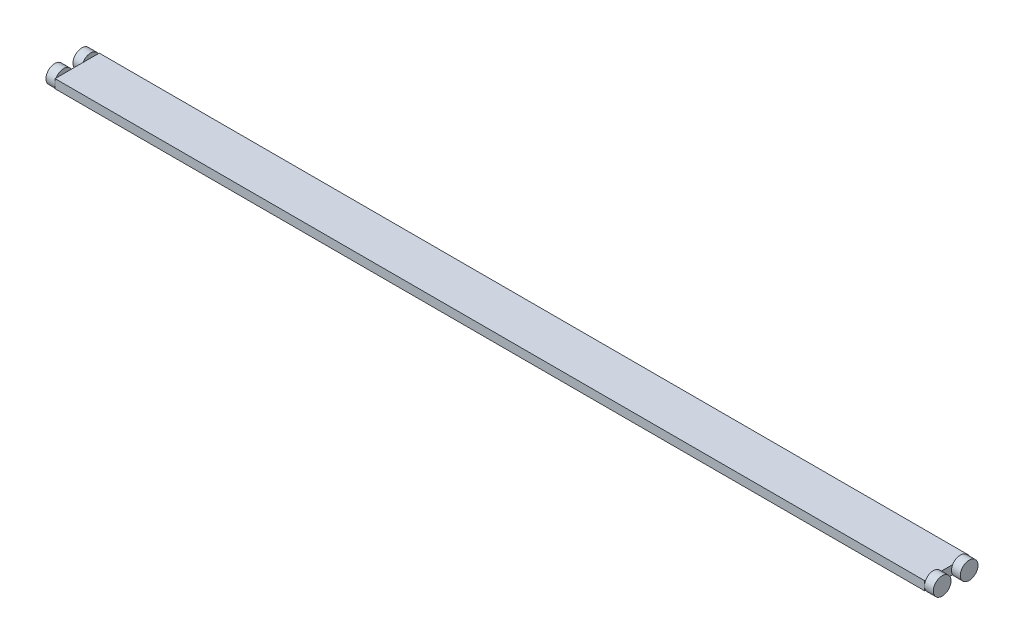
ISO-10303-21;
HEADER;
FILE_DESCRIPTION(('STEP AP214'),'2;1');
FILE_NAME('part.step','',(''),(''),'','','');
FILE_SCHEMA(('AUTOMOTIVE_DESIGN { 1 0 10303 214 1 1 1 1 }'));
ENDSEC;
DATA;
#1=APPLICATION_CONTEXT('core data for automotive mechanical design processes');
#2=APPLICATION_PROTOCOL_DEFINITION('international standard','automotive_design',2000,#1);
#3=PRODUCT_CONTEXT('',#1,'mechanical');
#4=PRODUCT('Part','Part','',(#3));
#5=PRODUCT_RELATED_PRODUCT_CATEGORY('part','',(#4));
#6=PRODUCT_DEFINITION_FORMATION('','',#4);
#7=PRODUCT_DEFINITION_CONTEXT('part definition',#1,'design');
#8=PRODUCT_DEFINITION('design','',#6,#7);
#9=PRODUCT_DEFINITION_SHAPE('','',#8);
#10=(LENGTH_UNIT() NAMED_UNIT(*) SI_UNIT(.MILLI.,.METRE.));
#11=(NAMED_UNIT(*) PLANE_ANGLE_UNIT() SI_UNIT($,.RADIAN.));
#12=(NAMED_UNIT(*) SI_UNIT($,.STERADIAN.) SOLID_ANGLE_UNIT());
#13=UNCERTAINTY_MEASURE_WITH_UNIT(LENGTH_MEASURE(1.E-05),#10,'distance_accuracy_value','');
#14=(GEOMETRIC_REPRESENTATION_CONTEXT(3) GLOBAL_UNCERTAINTY_ASSIGNED_CONTEXT((#13)) GLOBAL_UNIT_ASSIGNED_CONTEXT((#10,
#11,#12)) REPRESENTATION_CONTEXT('',''));
#15=CARTESIAN_POINT('',(0.,0.,0.));
#16=DIRECTION('',(0.,0.,1.));
#17=DIRECTION('',(1.,0.,0.));
#18=AXIS2_PLACEMENT_3D('',#15,#16,#17);
#19=CARTESIAN_POINT('',(-492.,5.,25.));
#20=DIRECTION('',(1.,0.,0.));
#21=DIRECTION('',(0.,0.,-1.));
#22=AXIS2_PLACEMENT_3D('',#19,#20,#21);
#23=PLANE('',#22);
#24=DIRECTION('',(0.,0.,1.));
#25=VECTOR('',#24,1.);
#26=CARTESIAN_POINT('',(-492.,5.,25.));
#27=LINE('',#26,#25);
#28=CARTESIAN_POINT('',(-492.,5.,23.9431883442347));
#29=VERTEX_POINT('',#28);
#30=CARTESIAN_POINT('',(-492.,5.,25.));
#31=VERTEX_POINT('',#30);
#32=EDGE_CURVE('E231',#29,#31,#27,.T.);
#33=ORIENTED_EDGE('',*,*,#32,.F.);
#34=CARTESIAN_POINT('',(-492.,0.,15.2829343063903));
#35=DIRECTION('',(1.,0.,0.));
#36=DIRECTION('',(0.,0.,-1.));
#37=AXIS2_PLACEMENT_3D('',#34,#35,#36);
#38=CIRCLE('',#37,10.);
#39=CARTESIAN_POINT('',(-492.,2.36191327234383,25.));
#40=VERTEX_POINT('',#39);
#41=EDGE_CURVE('E61',#29,#40,#38,.T.);
#42=ORIENTED_EDGE('',*,*,#41,.T.);
#43=DIRECTION('',(0.,-1.,0.));
#44=VECTOR('',#43,1.);
#45=CARTESIAN_POINT('',(-492.,5.,25.));
#46=LINE('',#45,#44);
#47=EDGE_CURVE('E257',#31,#40,#46,.T.);
#48=ORIENTED_EDGE('',*,*,#47,.F.);
#49=EDGE_LOOP('',(#33,#42,#48));
#50=FACE_BOUND('',#49,.T.);
#51=ADVANCED_FACE('F35',(#50),#23,.F.);
#52=CARTESIAN_POINT('',(-492.,-2.36191327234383,25.));
#53=VERTEX_POINT('',#52);
#54=CARTESIAN_POINT('',(-492.,-5.,25.));
#55=VERTEX_POINT('',#54);
#56=EDGE_CURVE('E53',#53,#55,#46,.T.);
#57=ORIENTED_EDGE('',*,*,#56,.F.);
#58=CARTESIAN_POINT('',(-492.,-5.,23.9431883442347));
#59=VERTEX_POINT('',#58);
#60=EDGE_CURVE('E165',#53,#59,#38,.T.);
#61=ORIENTED_EDGE('',*,*,#60,.T.);
#62=DIRECTION('',(0.,0.,1.));
#63=VECTOR('',#62,1.);
#64=CARTESIAN_POINT('',(-492.,-5.,25.));
#65=LINE('',#64,#63);
#66=EDGE_CURVE('E152',#59,#55,#65,.T.);
#67=ORIENTED_EDGE('',*,*,#66,.T.);
#68=EDGE_LOOP('',(#57,#61,#67));
#69=FACE_BOUND('',#68,.T.);
#70=ADVANCED_FACE('F166',(#69),#23,.F.);
#71=DIRECTION('',(0.,-1.,0.));
#72=VECTOR('',#71,1.);
#73=CARTESIAN_POINT('',(-492.,5.,-25.));
#74=LINE('',#73,#72);
#75=CARTESIAN_POINT('',(-492.,5.,-25.));
#76=VERTEX_POINT('',#75);
#77=CARTESIAN_POINT('',(-492.,2.36191327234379,-25.));
#78=VERTEX_POINT('',#77);
#79=EDGE_CURVE('E259',#76,#78,#74,.T.);
#80=ORIENTED_EDGE('',*,*,#79,.T.);
#81=CARTESIAN_POINT('',(-492.,0.,-15.2829343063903));
#82=DIRECTION('',(1.,0.,0.));
#83=DIRECTION('',(0.,0.,-1.));
#84=AXIS2_PLACEMENT_3D('',#81,#82,#83);
#85=CIRCLE('',#84,10.);
#86=CARTESIAN_POINT('',(-492.,5.,-23.9431883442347));
#87=VERTEX_POINT('',#86);
#88=EDGE_CURVE('E197',#78,#87,#85,.T.);
#89=ORIENTED_EDGE('',*,*,#88,.T.);
#90=EDGE_CURVE('E232',#76,#87,#27,.T.);
#91=ORIENTED_EDGE('',*,*,#90,.F.);
#92=EDGE_LOOP('',(#80,#89,#91));
#93=FACE_BOUND('',#92,.T.);
#94=ADVANCED_FACE('F303',(#93),#23,.F.);
#95=CARTESIAN_POINT('',(-492.,-5.,-6.62268026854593));
#96=VERTEX_POINT('',#95);
#97=CARTESIAN_POINT('',(-492.,-5.,6.62268026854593));
#98=VERTEX_POINT('',#97);
#99=EDGE_CURVE('E177',#96,#98,#65,.T.);
#100=ORIENTED_EDGE('',*,*,#99,.T.);
#101=CARTESIAN_POINT('',(-492.,5.,6.62268026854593));
#102=VERTEX_POINT('',#101);
#103=EDGE_CURVE('E181',#98,#102,#38,.T.);
#104=ORIENTED_EDGE('',*,*,#103,.T.);
#105=CARTESIAN_POINT('',(-492.,5.,-6.62268026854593));
#106=VERTEX_POINT('',#105);
#107=EDGE_CURVE('E288',#106,#102,#27,.T.);
#108=ORIENTED_EDGE('',*,*,#107,.F.);
#109=EDGE_CURVE('E11',#106,#96,#85,.T.);
#110=ORIENTED_EDGE('',*,*,#109,.T.);
#111=EDGE_LOOP('',(#100,#104,#108,#110));
#112=FACE_BOUND('',#111,.T.);
#113=ADVANCED_FACE('F285',(#112),#23,.F.);
#114=CARTESIAN_POINT('',(492.,5.,25.));
#115=DIRECTION('',(-1.,0.,0.));
#116=DIRECTION('',(0.,0.,1.));
#117=AXIS2_PLACEMENT_3D('',#114,#115,#116);
#118=PLANE('',#117);
#119=CARTESIAN_POINT('',(492.,0.,15.2829343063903));
#120=DIRECTION('',(1.,0.,0.));
#121=DIRECTION('',(0.,0.,-1.));
#122=AXIS2_PLACEMENT_3D('',#119,#120,#121);
#123=CIRCLE('',#122,10.);
#124=CARTESIAN_POINT('',(492.,-2.36191327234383,25.));
#125=VERTEX_POINT('',#124);
#126=CARTESIAN_POINT('',(492.,-5.,23.9431883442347));
#127=VERTEX_POINT('',#126);
#128=EDGE_CURVE('E638',#125,#127,#123,.T.);
#129=ORIENTED_EDGE('',*,*,#128,.F.);
#130=DIRECTION('',(0.,-1.,0.));
#131=VECTOR('',#130,1.);
#132=CARTESIAN_POINT('',(492.,5.,25.));
#133=LINE('',#132,#131);
#134=CARTESIAN_POINT('',(492.,-5.,25.));
#135=VERTEX_POINT('',#134);
#136=EDGE_CURVE('E239',#125,#135,#133,.T.);
#137=ORIENTED_EDGE('',*,*,#136,.T.);
#138=DIRECTION('',(0.,0.,-1.));
#139=VECTOR('',#138,1.);
#140=CARTESIAN_POINT('',(492.,-5.,25.));
#141=LINE('',#140,#139);
#142=EDGE_CURVE('E240',#135,#127,#141,.T.);
#143=ORIENTED_EDGE('',*,*,#142,.T.);
#144=EDGE_LOOP('',(#129,#137,#143));
#145=FACE_BOUND('',#144,.T.);
#146=ADVANCED_FACE('F341',(#145),#118,.F.);
#147=CARTESIAN_POINT('',(492.,-5.,6.62268026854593));
#148=VERTEX_POINT('',#147);
#149=CARTESIAN_POINT('',(492.,5.,6.62268026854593));
#150=VERTEX_POINT('',#149);
#151=EDGE_CURVE('E196',#148,#150,#123,.T.);
#152=ORIENTED_EDGE('',*,*,#151,.F.);
#153=CARTESIAN_POINT('',(492.,-5.,-6.62268026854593));
#154=VERTEX_POINT('',#153);
#155=EDGE_CURVE('E244',#148,#154,#141,.T.);
#156=ORIENTED_EDGE('',*,*,#155,.T.);
#157=CARTESIAN_POINT('',(492.,0.,-15.2829343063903));
#158=DIRECTION('',(1.,0.,0.));
#159=DIRECTION('',(0.,0.,-1.));
#160=AXIS2_PLACEMENT_3D('',#157,#158,#159);
#161=CIRCLE('',#160,10.);
#162=CARTESIAN_POINT('',(492.,5.,-6.62268026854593));
#163=VERTEX_POINT('',#162);
#164=EDGE_CURVE('E316',#163,#154,#161,.T.);
#165=ORIENTED_EDGE('',*,*,#164,.F.);
#166=DIRECTION('',(0.,0.,-1.));
#167=VECTOR('',#166,1.);
#168=CARTESIAN_POINT('',(492.,5.,25.));
#169=LINE('',#168,#167);
#170=EDGE_CURVE('E227',#150,#163,#169,.T.);
#171=ORIENTED_EDGE('',*,*,#170,.F.);
#172=EDGE_LOOP('',(#152,#156,#165,#171));
#173=FACE_BOUND('',#172,.T.);
#174=ADVANCED_FACE('F317',(#173),#118,.F.);
#175=CARTESIAN_POINT('',(492.,2.36191327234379,-25.));
#176=VERTEX_POINT('',#175);
#177=CARTESIAN_POINT('',(492.,5.,-23.9431883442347));
#178=VERTEX_POINT('',#177);
#179=EDGE_CURVE('E218',#176,#178,#161,.T.);
#180=ORIENTED_EDGE('',*,*,#179,.F.);
#181=DIRECTION('',(0.,-1.,0.));
#182=VECTOR('',#181,1.);
#183=CARTESIAN_POINT('',(492.,5.,-25.));
#184=LINE('',#183,#182);
#185=CARTESIAN_POINT('',(492.,5.,-25.));
#186=VERTEX_POINT('',#185);
#187=EDGE_CURVE('E39',#186,#176,#184,.T.);
#188=ORIENTED_EDGE('',*,*,#187,.F.);
#189=EDGE_CURVE('E253',#178,#186,#169,.T.);
#190=ORIENTED_EDGE('',*,*,#189,.F.);
#191=EDGE_LOOP('',(#180,#188,#190));
#192=FACE_BOUND('',#191,.T.);
#193=ADVANCED_FACE('F333',(#192),#118,.F.);
#194=CARTESIAN_POINT('',(492.,5.,23.9431883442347));
#195=VERTEX_POINT('',#194);
#196=CARTESIAN_POINT('',(492.,2.36191327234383,25.));
#197=VERTEX_POINT('',#196);
#198=EDGE_CURVE('E207',#195,#197,#123,.T.);
#199=ORIENTED_EDGE('',*,*,#198,.F.);
#200=CARTESIAN_POINT('',(492.,5.,25.));
#201=VERTEX_POINT('',#200);
#202=EDGE_CURVE('E223',#201,#195,#169,.T.);
#203=ORIENTED_EDGE('',*,*,#202,.F.);
#204=EDGE_CURVE('E254',#201,#197,#133,.T.);
#205=ORIENTED_EDGE('',*,*,#204,.T.);
#206=EDGE_LOOP('',(#199,#203,#205));
#207=FACE_BOUND('',#206,.T.);
#208=ADVANCED_FACE('F335',(#207),#118,.F.);
#209=CARTESIAN_POINT('',(492.,-5.,-23.9431883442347));
#210=VERTEX_POINT('',#209);
#211=CARTESIAN_POINT('',(492.,-2.36191327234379,-25.));
#212=VERTEX_POINT('',#211);
#213=EDGE_CURVE('E222',#210,#212,#161,.T.);
#214=ORIENTED_EDGE('',*,*,#213,.F.);
#215=CARTESIAN_POINT('',(492.,-5.,-25.));
#216=VERTEX_POINT('',#215);
#217=EDGE_CURVE('E217',#210,#216,#141,.T.);
#218=ORIENTED_EDGE('',*,*,#217,.T.);
#219=EDGE_CURVE('E261',#212,#216,#184,.T.);
#220=ORIENTED_EDGE('',*,*,#219,.F.);
#221=EDGE_LOOP('',(#214,#218,#220));
#222=FACE_BOUND('',#221,.T.);
#223=ADVANCED_FACE('F37',(#222),#118,.F.);
#224=CARTESIAN_POINT('',(-492.,5.,-25.));
#225=DIRECTION('',(0.,0.,1.));
#226=DIRECTION('',(1.,0.,0.));
#227=AXIS2_PLACEMENT_3D('',#224,#225,#226);
#228=PLANE('',#227);
#229=DIRECTION('',(-1.,0.,0.));
#230=VECTOR('',#229,1.);
#231=CARTESIAN_POINT('',(-492.,-5.,-25.));
#232=LINE('',#231,#230);
#233=CARTESIAN_POINT('',(-492.,-5.,-25.));
#234=VERTEX_POINT('',#233);
#235=EDGE_CURVE('E161',#216,#234,#232,.T.);
#236=ORIENTED_EDGE('',*,*,#235,.T.);
#237=CARTESIAN_POINT('',(-492.,-2.36191327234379,-25.));
#238=VERTEX_POINT('',#237);
#239=EDGE_CURVE('E258',#238,#234,#74,.T.);
#240=ORIENTED_EDGE('',*,*,#239,.F.);
#241=EDGE_CURVE('E262',#78,#238,#74,.T.);
#242=ORIENTED_EDGE('',*,*,#241,.F.);
#243=ORIENTED_EDGE('',*,*,#79,.F.);
#244=DIRECTION('',(-1.,0.,0.));
#245=VECTOR('',#244,1.);
#246=CARTESIAN_POINT('',(-492.,5.,-25.));
#247=LINE('',#246,#245);
#248=EDGE_CURVE('E226',#186,#76,#247,.T.);
#249=ORIENTED_EDGE('',*,*,#248,.F.);
#250=ORIENTED_EDGE('',*,*,#187,.T.);
#251=EDGE_CURVE('E266',#176,#212,#184,.T.);
#252=ORIENTED_EDGE('',*,*,#251,.T.);
#253=ORIENTED_EDGE('',*,*,#219,.T.);
#254=EDGE_LOOP('',(#236,#240,#242,#243,#249,#250,#252,#253));
#255=FACE_BOUND('',#254,.T.);
#256=ADVANCED_FACE('F276',(#255),#228,.F.);
#257=CARTESIAN_POINT('',(-492.,-5.,-23.9431883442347));
#258=VERTEX_POINT('',#257);
#259=EDGE_CURVE('E163',#234,#258,#65,.T.);
#260=ORIENTED_EDGE('',*,*,#259,.T.);
#261=EDGE_CURVE('E44',#258,#238,#85,.T.);
#262=ORIENTED_EDGE('',*,*,#261,.T.);
#263=ORIENTED_EDGE('',*,*,#239,.T.);
#264=EDGE_LOOP('',(#260,#262,#263));
#265=FACE_BOUND('',#264,.T.);
#266=ADVANCED_FACE('F271',(#265),#23,.F.);
#267=CARTESIAN_POINT('',(-492.,5.,25.));
#268=DIRECTION('',(0.,0.,-1.));
#269=DIRECTION('',(-1.,0.,0.));
#270=AXIS2_PLACEMENT_3D('',#267,#268,#269);
#271=PLANE('',#270);
#272=DIRECTION('',(1.,0.,0.));
#273=VECTOR('',#272,1.);
#274=CARTESIAN_POINT('',(-492.,-5.,25.));
#275=LINE('',#274,#273);
#276=EDGE_CURVE('E160',#55,#135,#275,.T.);
#277=ORIENTED_EDGE('',*,*,#276,.T.);
#278=ORIENTED_EDGE('',*,*,#136,.F.);
#279=DIRECTION('',(0.,-1.,0.));
#280=VECTOR('',#279,1.);
#281=CARTESIAN_POINT('',(492.,5.,25.));
#282=LINE('',#281,#280);
#283=EDGE_CURVE('E210',#197,#125,#282,.T.);
#284=ORIENTED_EDGE('',*,*,#283,.F.);
#285=ORIENTED_EDGE('',*,*,#204,.F.);
#286=DIRECTION('',(1.,0.,0.));
#287=VECTOR('',#286,1.);
#288=CARTESIAN_POINT('',(-492.,5.,25.));
#289=LINE('',#288,#287);
#290=EDGE_CURVE('E235',#31,#201,#289,.T.);
#291=ORIENTED_EDGE('',*,*,#290,.F.);
#292=ORIENTED_EDGE('',*,*,#47,.T.);
#293=DIRECTION('',(0.,1.,0.));
#294=VECTOR('',#293,1.);
#295=CARTESIAN_POINT('',(-492.,5.,25.));
#296=LINE('',#295,#294);
#297=EDGE_CURVE('E190',#53,#40,#296,.T.);
#298=ORIENTED_EDGE('',*,*,#297,.F.);
#299=ORIENTED_EDGE('',*,*,#56,.T.);
#300=EDGE_LOOP('',(#277,#278,#284,#285,#291,#292,#298,#299));
#301=FACE_BOUND('',#300,.T.);
#302=ADVANCED_FACE('F349',(#301),#271,.F.);
#303=CARTESIAN_POINT('',(0.,5.,0.));
#304=DIRECTION('',(0.,-1.,0.));
#305=DIRECTION('',(0.,0.,-1.));
#306=AXIS2_PLACEMENT_3D('',#303,#304,#305);
#307=PLANE('',#306);
#308=ORIENTED_EDGE('',*,*,#202,.T.);
#309=DIRECTION('',(0.,0.,1.));
#310=VECTOR('',#309,1.);
#311=CARTESIAN_POINT('',(492.,5.,0.));
#312=LINE('',#311,#310);
#313=EDGE_CURVE('E203',#150,#195,#312,.T.);
#314=ORIENTED_EDGE('',*,*,#313,.F.);
#315=ORIENTED_EDGE('',*,*,#170,.T.);
#316=EDGE_CURVE('E228',#163,#178,#169,.T.);
#317=ORIENTED_EDGE('',*,*,#316,.T.);
#318=ORIENTED_EDGE('',*,*,#189,.T.);
#319=ORIENTED_EDGE('',*,*,#248,.T.);
#320=ORIENTED_EDGE('',*,*,#90,.T.);
#321=EDGE_CURVE('E236',#87,#106,#27,.T.);
#322=ORIENTED_EDGE('',*,*,#321,.T.);
#323=ORIENTED_EDGE('',*,*,#107,.T.);
#324=DIRECTION('',(0.,0.,-1.));
#325=VECTOR('',#324,1.);
#326=CARTESIAN_POINT('',(-492.,5.,0.));
#327=LINE('',#326,#325);
#328=EDGE_CURVE('E187',#29,#102,#327,.T.);
#329=ORIENTED_EDGE('',*,*,#328,.F.);
#330=ORIENTED_EDGE('',*,*,#32,.T.);
#331=ORIENTED_EDGE('',*,*,#290,.T.);
#332=EDGE_LOOP('',(#308,#314,#315,#317,#318,#319,#320,#322,#323,#329,#330,#331));
#333=FACE_BOUND('',#332,.T.);
#334=ADVANCED_FACE('F305',(#333),#307,.F.);
#335=CARTESIAN_POINT('',(0.,-5.,0.));
#336=DIRECTION('',(0.,-1.,0.));
#337=DIRECTION('',(0.,0.,-1.));
#338=AXIS2_PLACEMENT_3D('',#335,#336,#337);
#339=PLANE('',#338);
#340=ORIENTED_EDGE('',*,*,#142,.F.);
#341=ORIENTED_EDGE('',*,*,#276,.F.);
#342=ORIENTED_EDGE('',*,*,#66,.F.);
#343=EDGE_CURVE('E157',#98,#59,#65,.T.);
#344=ORIENTED_EDGE('',*,*,#343,.F.);
#345=ORIENTED_EDGE('',*,*,#99,.F.);
#346=EDGE_CURVE('E250',#258,#96,#65,.T.);
#347=ORIENTED_EDGE('',*,*,#346,.F.);
#348=ORIENTED_EDGE('',*,*,#259,.F.);
#349=ORIENTED_EDGE('',*,*,#235,.F.);
#350=ORIENTED_EDGE('',*,*,#217,.F.);
#351=EDGE_CURVE('E245',#154,#210,#141,.T.);
#352=ORIENTED_EDGE('',*,*,#351,.F.);
#353=ORIENTED_EDGE('',*,*,#155,.F.);
#354=EDGE_CURVE('E243',#127,#148,#141,.T.);
#355=ORIENTED_EDGE('',*,*,#354,.F.);
#356=EDGE_LOOP('',(#340,#341,#342,#344,#345,#347,#348,#349,#350,#352,#353,#355));
#357=FACE_BOUND('',#356,.T.);
#358=ADVANCED_FACE('F154',(#357),#339,.T.);
#359=CARTESIAN_POINT('',(492.,0.,-15.2829343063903));
#360=DIRECTION('',(1.,0.,0.));
#361=DIRECTION('',(0.,0.,-1.));
#362=AXIS2_PLACEMENT_3D('',#359,#360,#361);
#363=PLANE('',#362);
#364=EDGE_CURVE('E326',#154,#210,#161,.T.);
#365=ORIENTED_EDGE('',*,*,#364,.F.);
#366=ORIENTED_EDGE('',*,*,#351,.T.);
#367=EDGE_LOOP('',(#365,#366));
#368=FACE_BOUND('',#367,.T.);
#369=ADVANCED_FACE('F434',(#368),#363,.F.);
#370=ORIENTED_EDGE('',*,*,#251,.F.);
#371=EDGE_CURVE('E213',#212,#176,#161,.T.);
#372=ORIENTED_EDGE('',*,*,#371,.F.);
#373=EDGE_LOOP('',(#370,#372));
#374=FACE_BOUND('',#373,.T.);
#375=ADVANCED_FACE('F332',(#374),#363,.F.);
#376=CARTESIAN_POINT('',(502.,0.,-15.2829343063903));
#377=DIRECTION('',(-1.,0.,0.));
#378=DIRECTION('',(0.,0.,1.));
#379=AXIS2_PLACEMENT_3D('',#376,#377,#378);
#380=CYLINDRICAL_SURFACE('',#379,10.);
#381=CARTESIAN_POINT('',(502.,0.,-15.2829343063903));
#382=DIRECTION('',(1.,0.,0.));
#383=DIRECTION('',(0.,0.,-1.));
#384=AXIS2_PLACEMENT_3D('',#381,#382,#383);
#385=CIRCLE('',#384,10.);
#386=CARTESIAN_POINT('',(502.,0.,-25.2829343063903));
#387=VERTEX_POINT('',#386);
#388=EDGE_CURVE('E214',#387,#387,#385,.T.);
#389=ORIENTED_EDGE('',*,*,#388,.F.);
#390=EDGE_LOOP('',(#389));
#391=FACE_BOUND('',#390,.T.);
#392=ORIENTED_EDGE('',*,*,#179,.T.);
#393=EDGE_CURVE('E221',#178,#163,#161,.T.);
#394=ORIENTED_EDGE('',*,*,#393,.T.);
#395=ORIENTED_EDGE('',*,*,#164,.T.);
#396=ORIENTED_EDGE('',*,*,#364,.T.);
#397=ORIENTED_EDGE('',*,*,#213,.T.);
#398=ORIENTED_EDGE('',*,*,#371,.T.);
#399=EDGE_LOOP('',(#392,#394,#395,#396,#397,#398));
#400=FACE_BOUND('',#399,.T.);
#401=ADVANCED_FACE('F324',(#391,#400),#380,.T.);
#402=CARTESIAN_POINT('',(502.,0.,-15.2829343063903));
#403=DIRECTION('',(1.,0.,0.));
#404=DIRECTION('',(0.,0.,-1.));
#405=AXIS2_PLACEMENT_3D('',#402,#403,#404);
#406=PLANE('',#405);
#407=ORIENTED_EDGE('',*,*,#388,.T.);
#408=EDGE_LOOP('',(#407));
#409=FACE_BOUND('',#408,.T.);
#410=ADVANCED_FACE('F432',(#409),#406,.T.);
#411=ORIENTED_EDGE('',*,*,#316,.F.);
#412=ORIENTED_EDGE('',*,*,#393,.F.);
#413=EDGE_LOOP('',(#411,#412));
#414=FACE_BOUND('',#413,.T.);
#415=ADVANCED_FACE('F323',(#414),#363,.F.);
#416=CARTESIAN_POINT('',(492.,0.,15.2829343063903));
#417=DIRECTION('',(1.,0.,0.));
#418=DIRECTION('',(0.,0.,-1.));
#419=AXIS2_PLACEMENT_3D('',#416,#417,#418);
#420=PLANE('',#419);
#421=EDGE_CURVE('E639',#197,#125,#123,.T.);
#422=ORIENTED_EDGE('',*,*,#421,.F.);
#423=ORIENTED_EDGE('',*,*,#283,.T.);
#424=EDGE_LOOP('',(#422,#423));
#425=FACE_BOUND('',#424,.T.);
#426=ADVANCED_FACE('F386',(#425),#420,.F.);
#427=EDGE_CURVE('E204',#150,#195,#123,.T.);
#428=ORIENTED_EDGE('',*,*,#427,.F.);
#429=ORIENTED_EDGE('',*,*,#313,.T.);
#430=EDGE_LOOP('',(#428,#429));
#431=FACE_BOUND('',#430,.T.);
#432=ADVANCED_FACE('F387',(#431),#420,.F.);
#433=CARTESIAN_POINT('',(502.,0.,15.2829343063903));
#434=DIRECTION('',(-1.,0.,0.));
#435=DIRECTION('',(0.,0.,1.));
#436=AXIS2_PLACEMENT_3D('',#433,#434,#435);
#437=CYLINDRICAL_SURFACE('',#436,10.);
#438=CARTESIAN_POINT('',(502.,0.,15.2829343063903));
#439=DIRECTION('',(1.,0.,0.));
#440=DIRECTION('',(0.,0.,-1.));
#441=AXIS2_PLACEMENT_3D('',#438,#439,#440);
#442=CIRCLE('',#441,10.);
#443=CARTESIAN_POINT('',(502.,0.,5.28293430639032));
#444=VERTEX_POINT('',#443);
#445=EDGE_CURVE('E200',#444,#444,#442,.T.);
#446=ORIENTED_EDGE('',*,*,#445,.F.);
#447=EDGE_LOOP('',(#446));
#448=FACE_BOUND('',#447,.T.);
#449=ORIENTED_EDGE('',*,*,#427,.T.);
#450=ORIENTED_EDGE('',*,*,#198,.T.);
#451=ORIENTED_EDGE('',*,*,#421,.T.);
#452=ORIENTED_EDGE('',*,*,#128,.T.);
#453=EDGE_CURVE('E636',#127,#148,#123,.T.);
#454=ORIENTED_EDGE('',*,*,#453,.T.);
#455=ORIENTED_EDGE('',*,*,#151,.T.);
#456=EDGE_LOOP('',(#449,#450,#451,#452,#454,#455));
#457=FACE_BOUND('',#456,.T.);
#458=ADVANCED_FACE('F397',(#448,#457),#437,.T.);
#459=CARTESIAN_POINT('',(502.,0.,15.2829343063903));
#460=DIRECTION('',(1.,0.,0.));
#461=DIRECTION('',(0.,0.,-1.));
#462=AXIS2_PLACEMENT_3D('',#459,#460,#461);
#463=PLANE('',#462);
#464=ORIENTED_EDGE('',*,*,#445,.T.);
#465=EDGE_LOOP('',(#464));
#466=FACE_BOUND('',#465,.T.);
#467=ADVANCED_FACE('F383',(#466),#463,.T.);
#468=ORIENTED_EDGE('',*,*,#354,.T.);
#469=ORIENTED_EDGE('',*,*,#453,.F.);
#470=EDGE_LOOP('',(#468,#469));
#471=FACE_BOUND('',#470,.T.);
#472=ADVANCED_FACE('F377',(#471),#420,.F.);
#473=CARTESIAN_POINT('',(-492.,0.,-15.2829343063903));
#474=DIRECTION('',(-1.,0.,0.));
#475=DIRECTION('',(0.,0.,-1.));
#476=AXIS2_PLACEMENT_3D('',#473,#474,#475);
#477=PLANE('',#476);
#478=EDGE_CURVE('E295',#96,#258,#85,.T.);
#479=ORIENTED_EDGE('',*,*,#478,.T.);
#480=ORIENTED_EDGE('',*,*,#346,.T.);
#481=EDGE_LOOP('',(#479,#480));
#482=FACE_BOUND('',#481,.T.);
#483=ADVANCED_FACE('F382',(#482),#477,.F.);
#484=EDGE_CURVE('E193',#238,#78,#85,.T.);
#485=ORIENTED_EDGE('',*,*,#484,.T.);
#486=ORIENTED_EDGE('',*,*,#241,.T.);
#487=EDGE_LOOP('',(#485,#486));
#488=FACE_BOUND('',#487,.T.);
#489=ADVANCED_FACE('F299',(#488),#477,.F.);
#490=CARTESIAN_POINT('',(-502.,0.,-15.2829343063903));
#491=DIRECTION('',(1.,0.,0.));
#492=DIRECTION('',(0.,0.,-1.));
#493=AXIS2_PLACEMENT_3D('',#490,#491,#492);
#494=CYLINDRICAL_SURFACE('',#493,10.);
#495=CARTESIAN_POINT('',(-502.,0.,-15.2829343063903));
#496=DIRECTION('',(1.,0.,0.));
#497=DIRECTION('',(0.,0.,-1.));
#498=AXIS2_PLACEMENT_3D('',#495,#496,#497);
#499=CIRCLE('',#498,10.);
#500=CARTESIAN_POINT('',(-502.,0.,-25.2829343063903));
#501=VERTEX_POINT('',#500);
#502=EDGE_CURVE('E194',#501,#501,#499,.T.);
#503=ORIENTED_EDGE('',*,*,#502,.T.);
#504=EDGE_LOOP('',(#503));
#505=FACE_BOUND('',#504,.T.);
#506=ORIENTED_EDGE('',*,*,#88,.F.);
#507=ORIENTED_EDGE('',*,*,#484,.F.);
#508=ORIENTED_EDGE('',*,*,#261,.F.);
#509=ORIENTED_EDGE('',*,*,#478,.F.);
#510=ORIENTED_EDGE('',*,*,#109,.F.);
#511=EDGE_CURVE('E46',#87,#106,#85,.T.);
#512=ORIENTED_EDGE('',*,*,#511,.F.);
#513=EDGE_LOOP('',(#506,#507,#508,#509,#510,#512));
#514=FACE_BOUND('',#513,.T.);
#515=ADVANCED_FACE('F294',(#505,#514),#494,.T.);
#516=CARTESIAN_POINT('',(-502.,0.,-15.2829343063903));
#517=DIRECTION('',(-1.,0.,0.));
#518=DIRECTION('',(0.,0.,-1.));
#519=AXIS2_PLACEMENT_3D('',#516,#517,#518);
#520=PLANE('',#519);
#521=ORIENTED_EDGE('',*,*,#502,.F.);
#522=EDGE_LOOP('',(#521));
#523=FACE_BOUND('',#522,.T.);
#524=ADVANCED_FACE('F541',(#523),#520,.T.);
#525=ORIENTED_EDGE('',*,*,#321,.F.);
#526=ORIENTED_EDGE('',*,*,#511,.T.);
#527=EDGE_LOOP('',(#525,#526));
#528=FACE_BOUND('',#527,.T.);
#529=ADVANCED_FACE('F297',(#528),#477,.F.);
#530=CARTESIAN_POINT('',(-492.,0.,15.2829343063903));
#531=DIRECTION('',(-1.,0.,0.));
#532=DIRECTION('',(0.,0.,-1.));
#533=AXIS2_PLACEMENT_3D('',#530,#531,#532);
#534=PLANE('',#533);
#535=EDGE_CURVE('E171',#40,#53,#38,.T.);
#536=ORIENTED_EDGE('',*,*,#535,.T.);
#537=ORIENTED_EDGE('',*,*,#297,.T.);
#538=EDGE_LOOP('',(#536,#537));
#539=FACE_BOUND('',#538,.T.);
#540=ADVANCED_FACE('F545',(#539),#534,.F.);
#541=EDGE_CURVE('E182',#102,#29,#38,.T.);
#542=ORIENTED_EDGE('',*,*,#541,.T.);
#543=ORIENTED_EDGE('',*,*,#328,.T.);
#544=EDGE_LOOP('',(#542,#543));
#545=FACE_BOUND('',#544,.T.);
#546=ADVANCED_FACE('F552',(#545),#534,.F.);
#547=CARTESIAN_POINT('',(-502.,0.,15.2829343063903));
#548=DIRECTION('',(1.,0.,0.));
#549=DIRECTION('',(0.,0.,-1.));
#550=AXIS2_PLACEMENT_3D('',#547,#548,#549);
#551=CYLINDRICAL_SURFACE('',#550,10.);
#552=CARTESIAN_POINT('',(-502.,0.,15.2829343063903));
#553=DIRECTION('',(1.,0.,0.));
#554=DIRECTION('',(0.,0.,-1.));
#555=AXIS2_PLACEMENT_3D('',#552,#553,#554);
#556=CIRCLE('',#555,10.);
#557=CARTESIAN_POINT('',(-502.,0.,5.28293430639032));
#558=VERTEX_POINT('',#557);
#559=EDGE_CURVE('E186',#558,#558,#556,.T.);
#560=ORIENTED_EDGE('',*,*,#559,.T.);
#561=EDGE_LOOP('',(#560));
#562=FACE_BOUND('',#561,.T.);
#563=ORIENTED_EDGE('',*,*,#541,.F.);
#564=ORIENTED_EDGE('',*,*,#103,.F.);
#565=EDGE_CURVE('E172',#59,#98,#38,.T.);
#566=ORIENTED_EDGE('',*,*,#565,.F.);
#567=ORIENTED_EDGE('',*,*,#60,.F.);
#568=ORIENTED_EDGE('',*,*,#535,.F.);
#569=ORIENTED_EDGE('',*,*,#41,.F.);
#570=EDGE_LOOP('',(#563,#564,#566,#567,#568,#569));
#571=FACE_BOUND('',#570,.T.);
#572=ADVANCED_FACE('F180',(#562,#571),#551,.T.);
#573=CARTESIAN_POINT('',(-502.,0.,15.2829343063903));
#574=DIRECTION('',(-1.,0.,0.));
#575=DIRECTION('',(0.,0.,-1.));
#576=AXIS2_PLACEMENT_3D('',#573,#574,#575);
#577=PLANE('',#576);
#578=ORIENTED_EDGE('',*,*,#559,.F.);
#579=EDGE_LOOP('',(#578));
#580=FACE_BOUND('',#579,.T.);
#581=ADVANCED_FACE('F551',(#580),#577,.T.);
#582=ORIENTED_EDGE('',*,*,#343,.T.);
#583=ORIENTED_EDGE('',*,*,#565,.T.);
#584=EDGE_LOOP('',(#582,#583));
#585=FACE_BOUND('',#584,.T.);
#586=ADVANCED_FACE('F176',(#585),#534,.F.);
#587=CLOSED_SHELL('',(#51,#70,#94,#113,#146,#174,#193,#208,#223,#256,#266,#302,#334,#358,#369,
#375,#401,#410,#415,#426,#432,#458,#467,#472,#483,#489,#515,#524,#529,#540,#546,#572,#581,#586));
#588=MANIFOLD_SOLID_BREP('B2',#587);
#589=ADVANCED_BREP_SHAPE_REPRESENTATION('',(#18,#588),#14);
#590=SHAPE_DEFINITION_REPRESENTATION(#9,#589);
ENDSEC;
END-ISO-10303-21;
